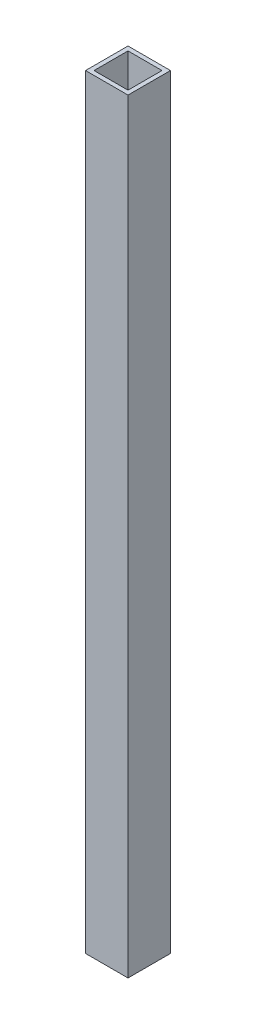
from build123d import *

# Parameters (mm, degrees)
ESQUISSE1_W        = 10
ESQUISSE1_H        = 10
ESQUISSE1_W_2      = 8
ESQUISSE1_H_2      = 8
BOSS_EXTRU_1_DEPTH = 180


with BuildPart() as part:
    # Esquisse1 → Boss.-Extru.1 (new body)
    with BuildSketch(Plane(origin=(0, 0, 0), x_dir=(1, 0, 0), z_dir=(0, 1, 0))):
        Rectangle(ESQUISSE1_W, ESQUISSE1_H)
        Rectangle(ESQUISSE1_W_2, ESQUISSE1_H_2, mode=Mode.SUBTRACT)
    extrude(amount=BOSS_EXTRU_1_DEPTH)


solid = part.part
